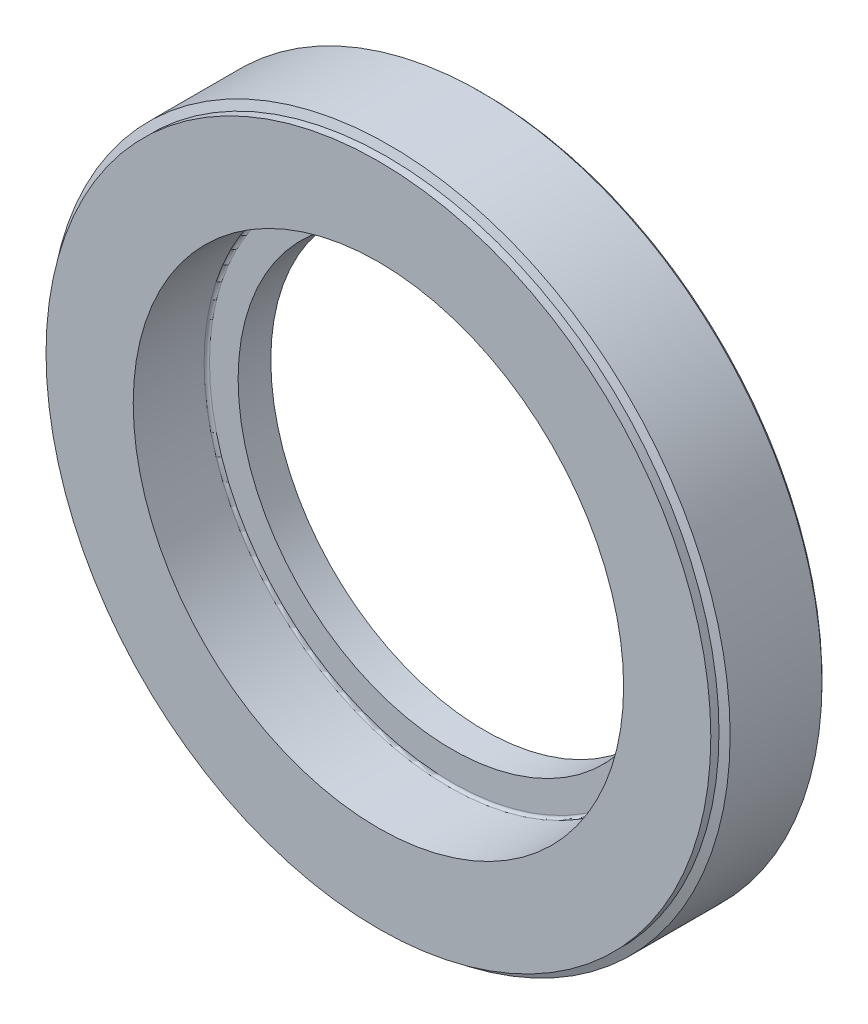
from build123d import *


with BuildPart() as part:
    # Skizze1 → Rotation1 (revolve)
    with BuildSketch(Plane(origin=(0, 0, 0), x_dir=(1, 0, 0), z_dir=(0, 1, 0)), mode=Mode.PRIVATE) as rotation1_sk:
        with BuildLine():
            Line((39.25, 19.5), (39.25, 13.5))
            Line((39.25, 13.5), (44.5, 13.5))
            ThreePointArc((44.5, 13.5), (44.853553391, 13.353553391), (45, 13))
            Line((45, 13), (45, 0))
            Line((45, 0), (61, 0))
            Line((61, 0), (61, 1.5))
            Line((61, 1.5), (62.5, 2.045955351))
            Line((62.5, 2.045955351), (62.5, 18.9))
            Line((62.5, 18.9), (61.9, 19.5))
            Line((61.9, 19.5), (39.25, 19.5))
        make_face()
    revolve(rotation1_sk.sketch.rotate(Axis((0, 0, 0), (0, 0, -1)), 180), axis=Axis((0, 0, 0), (0, 0, -1)))

    # Skizze2 → Schnitt-Rotation1 (revolve, cut)
    with BuildSketch(Plane(origin=(0, 0, 0), x_dir=(0, 0, -1), z_dir=(1, 0, 0)), mode=Mode.PRIVATE) as schnitt_rotation1_sk:
        Polygon((19.5, -55), (19.5, -57.5), (15.5, -57.5), (14.056624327, -55), align=None)
    revolve(schnitt_rotation1_sk.sketch.rotate(Axis((0, -55, -14.056624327), (0, 0, -1)), 90), axis=Axis((0, -55, -14.056624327), (0, 0, -1)), mode=Mode.SUBTRACT)


solid = part.part
